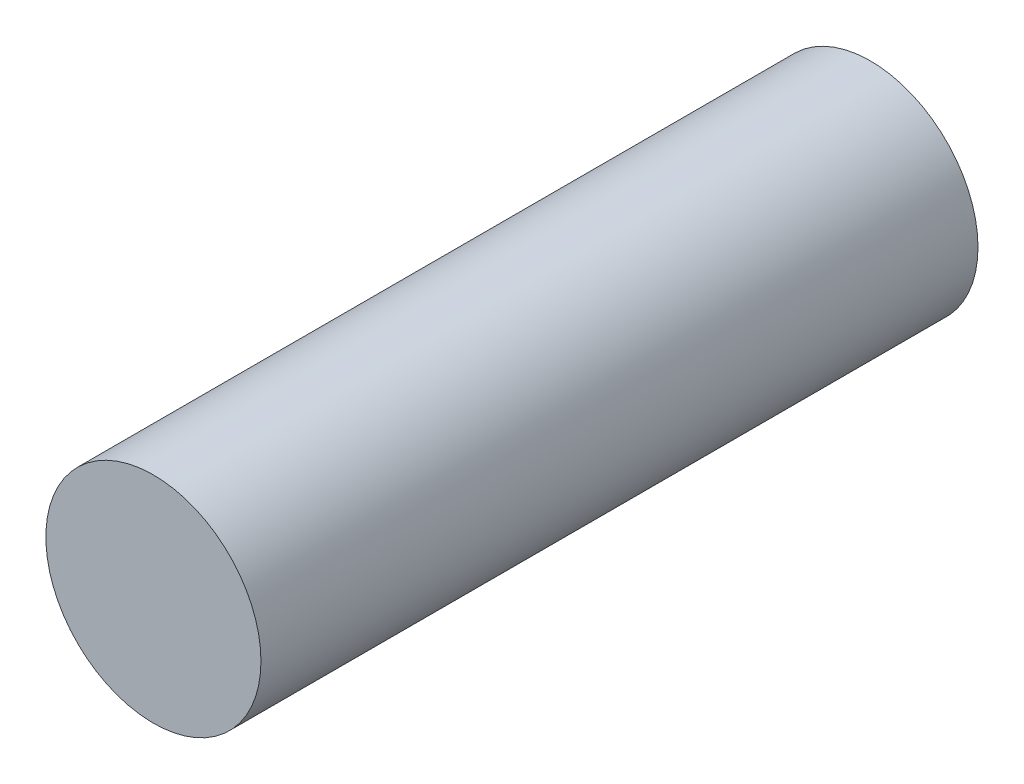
ISO-10303-21;
HEADER;
FILE_DESCRIPTION(('STEP AP214'),'2;1');
FILE_NAME('part.step','',(''),(''),'','','');
FILE_SCHEMA(('AUTOMOTIVE_DESIGN { 1 0 10303 214 1 1 1 1 }'));
ENDSEC;
DATA;
#1=APPLICATION_CONTEXT('core data for automotive mechanical design processes');
#2=APPLICATION_PROTOCOL_DEFINITION('international standard','automotive_design',2000,#1);
#3=PRODUCT_CONTEXT('',#1,'mechanical');
#4=PRODUCT('Part','Part','',(#3));
#5=PRODUCT_RELATED_PRODUCT_CATEGORY('part','',(#4));
#6=PRODUCT_DEFINITION_FORMATION('','',#4);
#7=PRODUCT_DEFINITION_CONTEXT('part definition',#1,'design');
#8=PRODUCT_DEFINITION('design','',#6,#7);
#9=PRODUCT_DEFINITION_SHAPE('','',#8);
#10=(LENGTH_UNIT() NAMED_UNIT(*) SI_UNIT(.MILLI.,.METRE.));
#11=(NAMED_UNIT(*) PLANE_ANGLE_UNIT() SI_UNIT($,.RADIAN.));
#12=(NAMED_UNIT(*) SI_UNIT($,.STERADIAN.) SOLID_ANGLE_UNIT());
#13=UNCERTAINTY_MEASURE_WITH_UNIT(LENGTH_MEASURE(1.E-05),#10,'distance_accuracy_value','');
#14=(GEOMETRIC_REPRESENTATION_CONTEXT(3) GLOBAL_UNCERTAINTY_ASSIGNED_CONTEXT((#13)) GLOBAL_UNIT_ASSIGNED_CONTEXT((#10,
#11,#12)) REPRESENTATION_CONTEXT('',''));
#15=CARTESIAN_POINT('',(0.,0.,0.));
#16=DIRECTION('',(0.,0.,1.));
#17=DIRECTION('',(1.,0.,0.));
#18=AXIS2_PLACEMENT_3D('',#15,#16,#17);
#19=CARTESIAN_POINT('',(0.,0.,-200.));
#20=DIRECTION('',(0.,0.,1.));
#21=DIRECTION('',(1.,0.,0.));
#22=AXIS2_PLACEMENT_3D('',#19,#20,#21);
#23=CYLINDRICAL_SURFACE('',#22,30.);
#24=CARTESIAN_POINT('',(0.,0.,-200.));
#25=DIRECTION('',(0.,0.,1.));
#26=DIRECTION('',(1.,0.,0.));
#27=AXIS2_PLACEMENT_3D('',#24,#25,#26);
#28=CIRCLE('',#27,30.);
#29=CARTESIAN_POINT('',(30.,0.,-200.));
#30=VERTEX_POINT('',#29);
#31=EDGE_CURVE('E10',#30,#30,#28,.T.);
#32=ORIENTED_EDGE('',*,*,#31,.T.);
#33=EDGE_LOOP('',(#32));
#34=FACE_BOUND('',#33,.T.);
#35=CARTESIAN_POINT('',(0.,0.,0.));
#36=DIRECTION('',(0.,0.,1.));
#37=DIRECTION('',(1.,0.,0.));
#38=AXIS2_PLACEMENT_3D('',#35,#36,#37);
#39=CIRCLE('',#38,30.);
#40=CARTESIAN_POINT('',(30.,0.,0.));
#41=VERTEX_POINT('',#40);
#42=EDGE_CURVE('E40',#41,#41,#39,.T.);
#43=ORIENTED_EDGE('',*,*,#42,.F.);
#44=EDGE_LOOP('',(#43));
#45=FACE_BOUND('',#44,.T.);
#46=ADVANCED_FACE('F37',(#34,#45),#23,.T.);
#47=CARTESIAN_POINT('',(0.,0.,-200.));
#48=DIRECTION('',(0.,0.,1.));
#49=DIRECTION('',(1.,0.,0.));
#50=AXIS2_PLACEMENT_3D('',#47,#48,#49);
#51=PLANE('',#50);
#52=ORIENTED_EDGE('',*,*,#31,.F.);
#53=EDGE_LOOP('',(#52));
#54=FACE_BOUND('',#53,.T.);
#55=ADVANCED_FACE('F54',(#54),#51,.F.);
#56=CARTESIAN_POINT('',(0.,0.,0.));
#57=DIRECTION('',(0.,0.,1.));
#58=DIRECTION('',(1.,0.,0.));
#59=AXIS2_PLACEMENT_3D('',#56,#57,#58);
#60=PLANE('',#59);
#61=ORIENTED_EDGE('',*,*,#42,.T.);
#62=EDGE_LOOP('',(#61));
#63=FACE_BOUND('',#62,.T.);
#64=ADVANCED_FACE('F51',(#63),#60,.T.);
#65=CLOSED_SHELL('',(#46,#55,#64));
#66=MANIFOLD_SOLID_BREP('B2',#65);
#67=ADVANCED_BREP_SHAPE_REPRESENTATION('',(#18,#66),#14);
#68=SHAPE_DEFINITION_REPRESENTATION(#9,#67);
ENDSEC;
END-ISO-10303-21;
